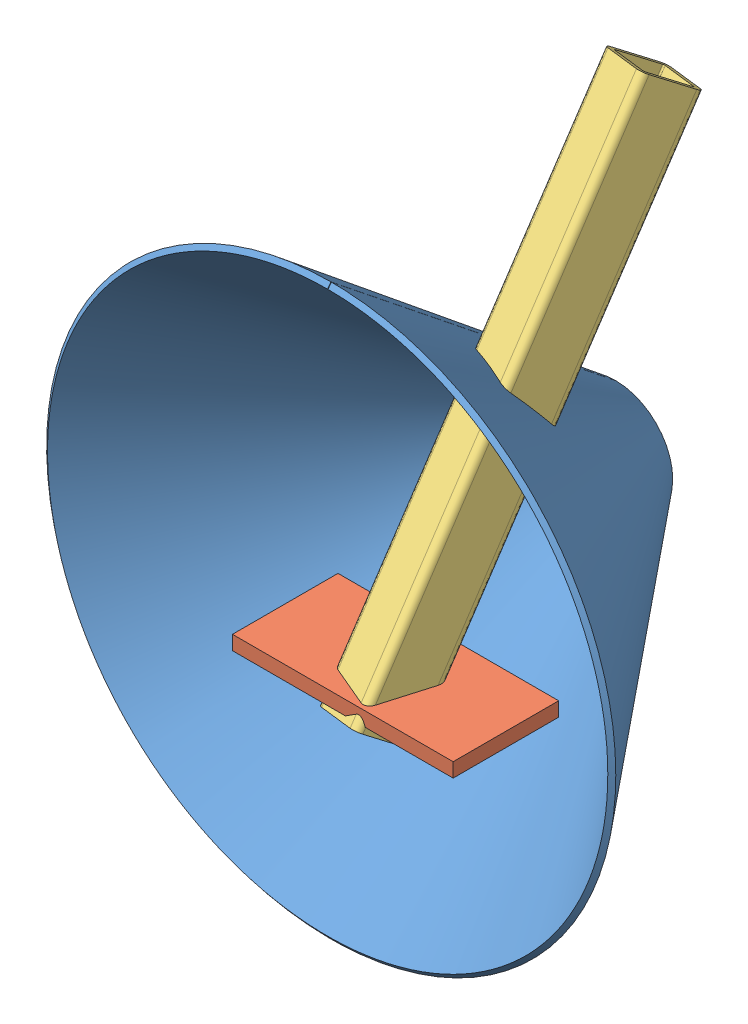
SolidWorks assembly Baugruppe2.SLDASM, configuration Standard (file format 3400). Lengths in mm.
Overall size (200.02 242.79 125.09).
3 component instances, 3 part files, 5 mates.
Components (placement in the parent):
- TRICHTER 0-2: TRICHTER 0.SLDPRT [Standard] at (-27.2885 7.3158 -33.4613) size (200.02 200.02 101.27)
- Teil1-1: Teil1.SLDPRT [Standard] x (-1 0 0) z (0 1 0) size (77.55 37.09 5)
- ROHR-2: ROHR.SLDPRT [Standard<Wie bearbeitet>] at (0 143.0066 -19.5958) x (0 -0.831219 0.555945) z (0.332804 -0.524254 -0.783836) size (180.97 20 20)
Mates (geometry in assembly coordinates):
- Deckungsgleich1: coincident: line of ROHR-2
- Platziert1: in place: moOrthogonalPlaneRef_w of Teil1-1
- Deckungsgleich2: coincident aligned: plane of ?; plane of assembly
- Deckungsgleich3: coincident aligned: plane of ?; moOrthogonalPlaneRef_w of assembly
- Deckungsgleich4: coincident anti-aligned: plane of ?; moOrthogonalPlaneRef_w of assembly
